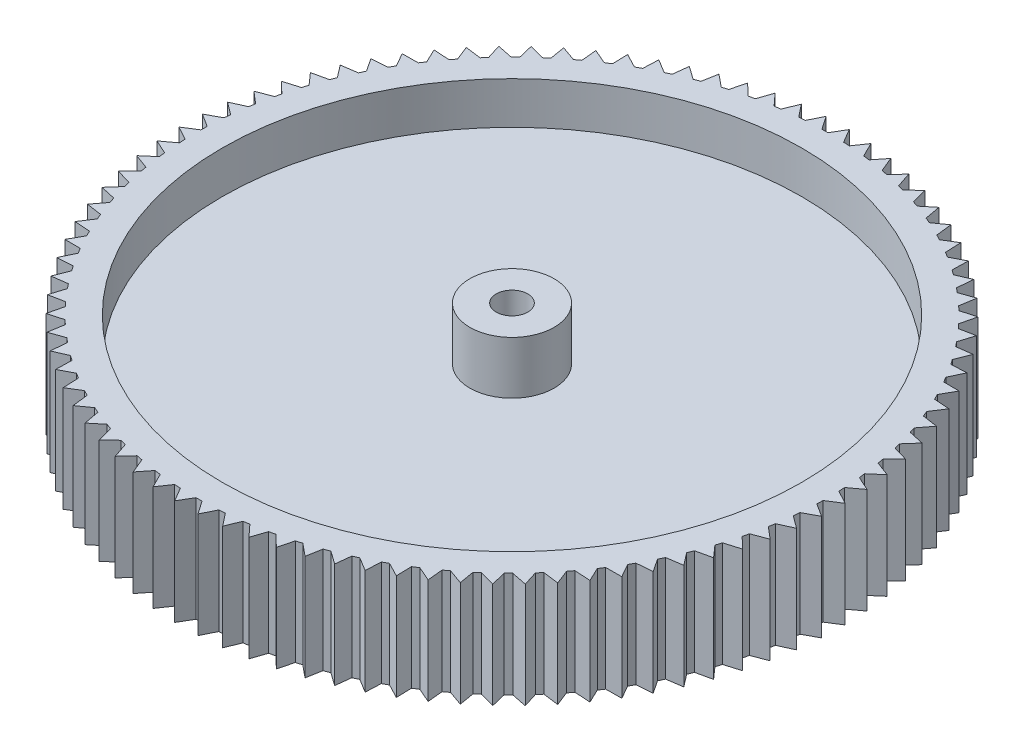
from build123d import *

# Parameters (mm, degrees)
SKETCH1_R           = 12.058419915
BOSS_EXTRUDE1_DEPTH = 10
SKETCH2_R           = 30
BOSS_EXTRUDE3_DEPTH = 5
SKETCH3_R           = 27.5
CUT_EXTRUDE1_DEPTH  = 4
CUT_EXTRUDE2_START  = -4
SKETCH4_R           = 27.5
CUT_EXTRUDE2_DEPTH  = 4
SKETCH5_R           = 4
BOSS_EXTRUDE4_DEPTH = 5
SKETCH6_R           = 1.5
CUT_EXTRUDE3_DEPTH  = 10
BOSS_EXTRUDE5_DEPTH = 10


with BuildPart() as part:
    # Sketch1 → Boss-Extrude1 (new body)
    with BuildSketch(Plane(origin=(0, 0, 0), x_dir=(1, 0, 0), z_dir=(0, 1, 0))):
        with Locations(Location((0, 0, 0), (0, 0, 270))):
            Circle(SKETCH1_R)
    extrude(amount=BOSS_EXTRUDE1_DEPTH)

    # Sketch2 → Boss-Extrude3 (add, symmetric)
    with BuildSketch(Plane(origin=(0, 5, 0), x_dir=(1, 0, 0), z_dir=(0, 1, 0))):
        with Locations(Location((0, 0, 0), (0, 0, 270))):
            Circle(SKETCH2_R)
    extrude(amount=BOSS_EXTRUDE3_DEPTH, both=True)

    # Sketch3 → Cut-Extrude1 (cut)
    with BuildSketch(Plane(origin=(0, 10, 0), x_dir=(1, 0, 0), z_dir=(0, 1, 0))):
        with Locations(Location((0, 0, 0), (0, 0, 270))):
            Circle(SKETCH3_R)
    extrude(amount=-CUT_EXTRUDE1_DEPTH, mode=Mode.SUBTRACT)

    # Sketch4 → Cut-Extrude2 (cut)
    with BuildSketch(Plane.XZ.offset(CUT_EXTRUDE2_START)):
        with Locations(Location((0, 0, 0), (0, 0, 90))):
            Circle(SKETCH4_R)
    extrude(amount=CUT_EXTRUDE2_DEPTH, mode=Mode.SUBTRACT)

    # Sketch5 → Boss-Extrude4 (add, symmetric)
    with BuildSketch(Plane(origin=(0, 6, 0), x_dir=(1, 0, 0), z_dir=(0, 1, 0))):
        with Locations(Location((0, 0, 0), (0, 0, 90))):
            Circle(SKETCH5_R)
    extrude(amount=BOSS_EXTRUDE4_DEPTH, both=True)

    # Sketch6 → Cut-Extrude3 (cut)
    with BuildSketch(Plane.XZ.offset(-1)):
        with Locations(Location((0, 0, 0), (0, 0, 270))):
            Circle(SKETCH6_R)
    extrude(amount=-CUT_EXTRUDE3_DEPTH, mode=Mode.SUBTRACT)

    # Sketch8 → Boss-Extrude5 (add)
    with BuildSketch(Plane(origin=(0, 10, 0), x_dir=(1, 0, 0), z_dir=(0, 1, 0))):
        Polygon((0, 30), (0.746596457, 31.270360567), (1.519609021, 29.961488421), align=None)
        Polygon((2.926087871, 31.142107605), (3.605915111, 29.782501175), (2.092694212, 29.926921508), align=None)
        Polygon((5.09132368, 30.862133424), (5.674653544, 29.458416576), (4.175193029, 29.708042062), align=None)
        Polygon((7.231755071, 30.431802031), (7.715745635, 28.990813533), (6.237350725, 29.344428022), align=None)
        Polygon((9.336954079, 29.853209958), (9.71924739, 28.38197016), (8.269120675, 28.837850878), align=None)
        Polygon((11.396664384, 29.129176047), (11.675397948, 27.634852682), (10.2606043, 28.190778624), align=None)
        Polygon((13.400851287, 28.263227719), (13.574667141, 26.753100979), (12.202099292, 27.406363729), align=None)
        Polygon((15.339750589, 27.259583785), (15.40780192, 25.741010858), (14.084146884, 26.488427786), align=None)
        Polygon((17.203916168, 26.1231339), (17.165871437, 24.603513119), (15.897577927, 25.441442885), align=None)
        Polygon((18.984265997, 24.859414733), (18.840310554, 23.346149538), (17.633557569, 24.270509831), align=None)
        Polygon((20.67212639, 23.474582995), (20.422961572, 21.975045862), (19.283628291, 22.981333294), align=None)
        Polygon((22.259274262, 21.975385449), (21.906113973, 20.496881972), (20.839751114, 21.58019401), align=None)
        Polygon((23.737977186, 20.369126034), (23.28254199, 18.918859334), (22.294344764, 20.073918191), align=None)
        Polygon((25.101031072, 18.663630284), (24.545539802, 17.248665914), (23.640322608, 18.46984426), align=None)
        Polygon((26.341795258, 16.867207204), (25.688954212, 15.494438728), (24.871127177, 16.775787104), align=None)
        Polygon((27.454224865, 14.988608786), (26.707214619, 13.664724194), (25.980762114, 15), align=None)
        Polygon((28.432900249, 13.036987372), (27.595360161, 11.768436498), (26.963821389, 13.151134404), align=None)
        Polygon((29.2730534, 11.021851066), (28.349063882, 9.814814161), (27.815515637, 11.238197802), align=None)
        Polygon((29.970591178, 8.95301741), (28.964653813, 7.813375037), (28.531695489, 9.270509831), align=None)
        Polygon((30.522115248, 6.840565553), (29.439130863, 5.773869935), (29.108871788, 7.257656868), align=None)
        Polygon((30.92493864, 4.694787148), (29.770183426, 3.706235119), (29.54423259, 5.20944533), align=None)
        Polygon((31.177098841, 2.526136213), (29.956198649, 1.620543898), (29.835656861, 3.135853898), align=None)
        Polygon((31.277367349, 0.345178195), (29.996270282, -0.47304245), (29.981724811, 1.046984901), align=None)
        Polygon((31.225255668, -1.837461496), (29.890203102, -2.564324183), (29.981724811, -1.046984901), align=None)
        Polygon((31.02101768, -4.011149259), (29.638513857, -4.643112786), (29.835656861, -3.135853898), align=None)
        Polygon((30.665648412, -6.165295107), (29.242428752, -6.69928061), (29.54423259, -5.20944533), align=None)
        Polygon((30.160879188, -8.289404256), (28.703877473, -8.722810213), (29.108871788, -7.257656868), align=None)
        Polygon((29.509169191, -10.373128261), (28.025483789, -10.703843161), (28.531695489, -9.270509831), align=None)
        Polygon((28.713693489, -12.406315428), (27.210552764, -12.632728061), (27.815515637, -11.238197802), align=None)
        Polygon((27.778327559, -14.379060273), (26.263054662, -14.50006758), (26.963821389, -13.151134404), align=None)
        Polygon((26.707628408, -16.281751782), (25.187605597, -16.296764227), (25.980762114, -15), align=None)
        Polygon((25.506812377, -18.105120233), (23.98944505, -18.014064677), (24.871127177, -16.775787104), align=None)
        Polygon((24.18172972, -19.840282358), (22.674410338, -19.643602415), (23.640322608, -18.46984426), align=None)
        Polygon((22.738836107, -21.478784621), (21.248908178, -21.177438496), (22.294344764, -20.073918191), align=None)
        Polygon((21.185161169, -23.012644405), (19.719883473, -22.608100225), (20.839751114, -21.58019401), align=None)
        Polygon((19.528274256, -24.434388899), (18.094785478, -23.928617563), (19.283628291, -22.981333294), align=None)
        Polygon((17.776247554, -25.737091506), (16.381531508, -25.132557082), (17.633557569, -24.270509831), align=None)
        Polygon((15.93761676, -26.91440559), (14.588468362, -26.214053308), (15.897577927, -25.441442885), align=None)
        Polygon((14.0213395, -27.960595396), (12.724331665, -27.167837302), (14.084146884, -26.488427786), align=None)
        Polygon((12.036751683, -28.870563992), (10.798203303, -27.989262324), (12.202099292, -27.406363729), align=None)
        Polygon((9.993522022, -29.639878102), (8.81946718, -28.674326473), (10.2606043, -28.190778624), align=None)
        Polygon((7.901604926, -30.264789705), (6.7977635, -29.219692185), (8.269120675, -28.837850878), align=None)
        Polygon((5.771192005, -30.742254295), (4.742941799, -29.622702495), (6.237350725, -29.344428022), align=None)
        Polygon((3.612662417, -31.069945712), (2.665012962, -29.881393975), (4.175193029, -29.708042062), align=None)
        Polygon((1.4365323, -31.246267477), (0.57410045, -29.994506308), (2.092694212, -29.926921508), align=None)
        Polygon((-0.746596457, -31.270360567), (-1.519609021, -29.961488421), (0, -30), align=None)
        Polygon((-2.926087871, -31.142107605), (-3.605915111, -29.782501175), (-2.092694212, -29.926921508), align=None)
        Polygon((-5.09132368, -30.862133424), (-5.674653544, -29.458416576), (-4.175193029, -29.708042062), align=None)
        Polygon((-7.231755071, -30.431802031), (-7.715745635, -28.990813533), (-6.237350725, -29.344428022), align=None)
        Polygon((-9.336954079, -29.853209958), (-9.71924739, -28.38197016), (-8.269120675, -28.837850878), align=None)
        Polygon((-11.396664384, -29.129176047), (-11.675397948, -27.634852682), (-10.2606043, -28.190778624), align=None)
        Polygon((-13.400851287, -28.263227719), (-13.574667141, -26.753100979), (-12.202099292, -27.406363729), align=None)
        Polygon((-15.339750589, -27.259583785), (-15.40780192, -25.741010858), (-14.084146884, -26.488427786), align=None)
        Polygon((-17.203916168, -26.1231339), (-17.165871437, -24.603513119), (-15.897577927, -25.441442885), align=None)
        Polygon((-18.984265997, -24.859414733), (-18.840310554, -23.346149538), (-17.633557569, -24.270509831), align=None)
        Polygon((-20.67212639, -23.474582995), (-20.422961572, -21.975045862), (-19.283628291, -22.981333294), align=None)
        Polygon((-22.259274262, -21.975385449), (-21.906113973, -20.496881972), (-20.839751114, -21.58019401), align=None)
        Polygon((-23.737977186, -20.369126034), (-23.28254199, -18.918859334), (-22.294344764, -20.073918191), align=None)
        Polygon((-25.101031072, -18.663630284), (-24.545539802, -17.248665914), (-23.640322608, -18.46984426), align=None)
        Polygon((-26.341795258, -16.867207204), (-25.688954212, -15.494438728), (-24.871127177, -16.775787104), align=None)
        Polygon((-27.454224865, -14.988608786), (-26.707214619, -13.664724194), (-25.980762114, -15), align=None)
        Polygon((-28.432900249, -13.036987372), (-27.595360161, -11.768436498), (-26.963821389, -13.151134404), align=None)
        Polygon((-29.2730534, -11.021851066), (-28.349063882, -9.814814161), (-27.815515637, -11.238197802), align=None)
        Polygon((-29.970591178, -8.95301741), (-28.964653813, -7.813375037), (-28.531695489, -9.270509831), align=None)
        Polygon((-30.522115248, -6.840565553), (-29.439130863, -5.773869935), (-29.108871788, -7.257656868), align=None)
        Polygon((-30.92493864, -4.694787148), (-29.770183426, -3.706235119), (-29.54423259, -5.20944533), align=None)
        Polygon((-31.177098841, -2.526136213), (-29.956198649, -1.620543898), (-29.835656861, -3.135853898), align=None)
        Polygon((-31.277367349, -0.345178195), (-29.996270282, 0.47304245), (-29.981724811, -1.046984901), align=None)
        Polygon((-31.225255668, 1.837461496), (-29.890203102, 2.564324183), (-29.981724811, 1.046984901), align=None)
        Polygon((-31.02101768, 4.011149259), (-29.638513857, 4.643112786), (-29.835656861, 3.135853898), align=None)
        Polygon((-30.665648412, 6.165295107), (-29.242428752, 6.69928061), (-29.54423259, 5.20944533), align=None)
        Polygon((-30.160879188, 8.289404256), (-28.703877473, 8.722810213), (-29.108871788, 7.257656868), align=None)
        Polygon((-29.509169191, 10.373128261), (-28.025483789, 10.703843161), (-28.531695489, 9.270509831), align=None)
        Polygon((-28.713693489, 12.406315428), (-27.210552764, 12.632728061), (-27.815515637, 11.238197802), align=None)
        Polygon((-27.778327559, 14.379060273), (-26.263054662, 14.50006758), (-26.963821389, 13.151134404), align=None)
        Polygon((-26.707628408, 16.281751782), (-25.187605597, 16.296764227), (-25.980762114, 15), align=None)
        Polygon((-25.506812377, 18.105120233), (-23.98944505, 18.014064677), (-24.871127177, 16.775787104), align=None)
        Polygon((-24.18172972, 19.840282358), (-22.674410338, 19.643602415), (-23.640322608, 18.46984426), align=None)
        Polygon((-22.738836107, 21.478784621), (-21.248908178, 21.177438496), (-22.294344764, 20.073918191), align=None)
        Polygon((-21.185161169, 23.012644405), (-19.719883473, 22.608100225), (-20.839751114, 21.58019401), align=None)
        Polygon((-19.528274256, 24.434388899), (-18.094785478, 23.928617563), (-19.283628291, 22.981333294), align=None)
        Polygon((-17.776247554, 25.737091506), (-16.381531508, 25.132557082), (-17.633557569, 24.270509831), align=None)
        Polygon((-15.93761676, 26.91440559), (-14.588468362, 26.214053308), (-15.897577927, 25.441442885), align=None)
        Polygon((-14.0213395, 27.960595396), (-12.724331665, 27.167837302), (-14.084146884, 26.488427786), align=None)
        Polygon((-12.036751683, 28.870563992), (-10.798203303, 27.989262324), (-12.202099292, 27.406363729), align=None)
        Polygon((-9.993522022, 29.639878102), (-8.81946718, 28.674326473), (-10.2606043, 28.190778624), align=None)
        Polygon((-7.901604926, 30.264789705), (-6.7977635, 29.219692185), (-8.269120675, 28.837850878), align=None)
        Polygon((-5.771192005, 30.742254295), (-4.742941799, 29.622702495), (-6.237350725, 29.344428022), align=None)
        Polygon((-3.612662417, 31.069945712), (-2.665012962, 29.881393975), (-4.175193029, 29.708042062), align=None)
        Polygon((-1.4365323, 31.246267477), (-0.57410045, 29.994506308), (-2.092694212, 29.926921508), align=None)
    extrude(amount=-BOSS_EXTRUDE5_DEPTH)


solid = part.part
